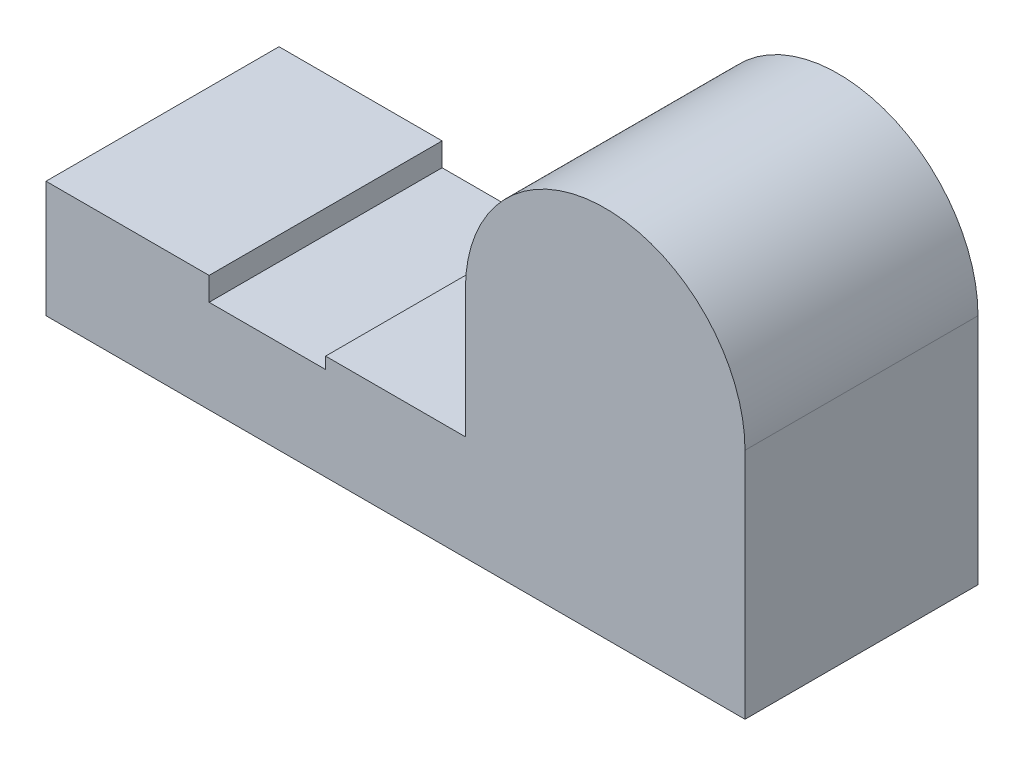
from build123d import *

# Parameters (mm, degrees)
BOSS_EXTRUDE1_DEPTH = 100


with BuildPart() as part:
    # Sketch2 → Boss-Extrude1 (new body)
    with BuildSketch(Plane.XY):
        with BuildLine():
            Line((40, 0), (340, 0))
            Line((340, 0), (340, 100))
            ThreePointArc((340, 100), (280, 160), (220, 100))
            Line((220, 100), (220, 45))
            Line((220, 45), (160, 45))
            Line((160, 45), (160, 40))
            Line((160, 40), (110, 40))
            Line((110, 40), (110, 50))
            Line((110, 50), (40, 50))
            Line((40, 50), (40, 0))
        make_face()
    extrude(amount=BOSS_EXTRUDE1_DEPTH)


solid = part.part
